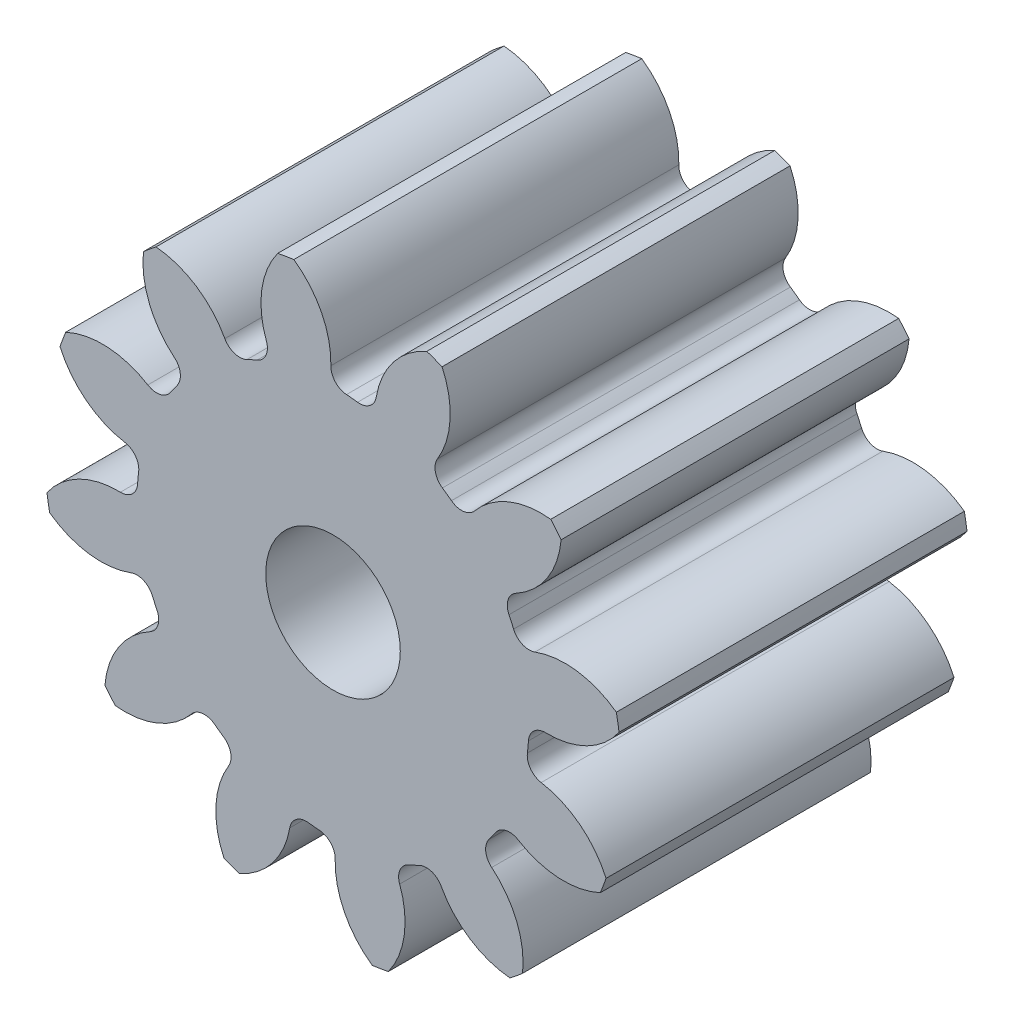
from build123d import *

# Parameters (mm, degrees)
SKETCH3_R         = 79.022222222
GEARBODY_DEPTH    = 95.25
TOOTHCUT_DEPTH    = 147.838638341
CIRPATTERN1_COUNT = 12
BOREDIA_R         = 18.415
BORE_DEPTH        = 12700


with BuildPart() as part:
    # Sketch3 → gearBody (new body)
    with BuildSketch(Plane.XY):
        Circle(SKETCH3_R)
    extrude(amount=GEARBODY_DEPTH)

    # Sketch2 → toothCut (cut, through all)
    with BuildSketch(Plane.XY):
        with BuildLine():
            ThreePointArc((53.198664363, -6.726427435), (53.368606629, -5.209082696), (53.495279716, -3.687514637))
            ThreePointArc((53.495279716, -3.687514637), (54.98697279, -0.6050013), (58.196327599, 0.589602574))
            ThreePointArc((58.196327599, 0.589602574), (70.110254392, 3.442462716), (79.022222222, 11.848251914))
            ThreePointArc((79.022222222, 11.848251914), (79.527596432, -7.762350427), (75.239672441, -26.905099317))
            ThreePointArc((75.239672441, -26.905099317), (68.121330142, -16.934659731), (56.983921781, -11.831856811))
            ThreePointArc((56.983921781, -11.831856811), (54.066139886, -10.039209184), (53.198664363, -6.726427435))
        make_face()
    toothcut = extrude(amount=TOOTHCUT_DEPTH, mode=Mode.SUBTRACT)

    # CirPattern1: toothCut ×12 about axis
    cirpattern1_axis = Axis((0, 0, 0), (0, 0, 1))
    for i in range(1, CIRPATTERN1_COUNT):
        add(toothcut.rotate(cirpattern1_axis, i * 360 / CIRPATTERN1_COUNT), mode=Mode.SUBTRACT)

    # boreDia → bore (cut, symmetric)
    with BuildSketch(Plane.XY):
        Circle(BOREDIA_R)
    extrude(amount=BORE_DEPTH, both=True, mode=Mode.SUBTRACT)


solid = part.part
